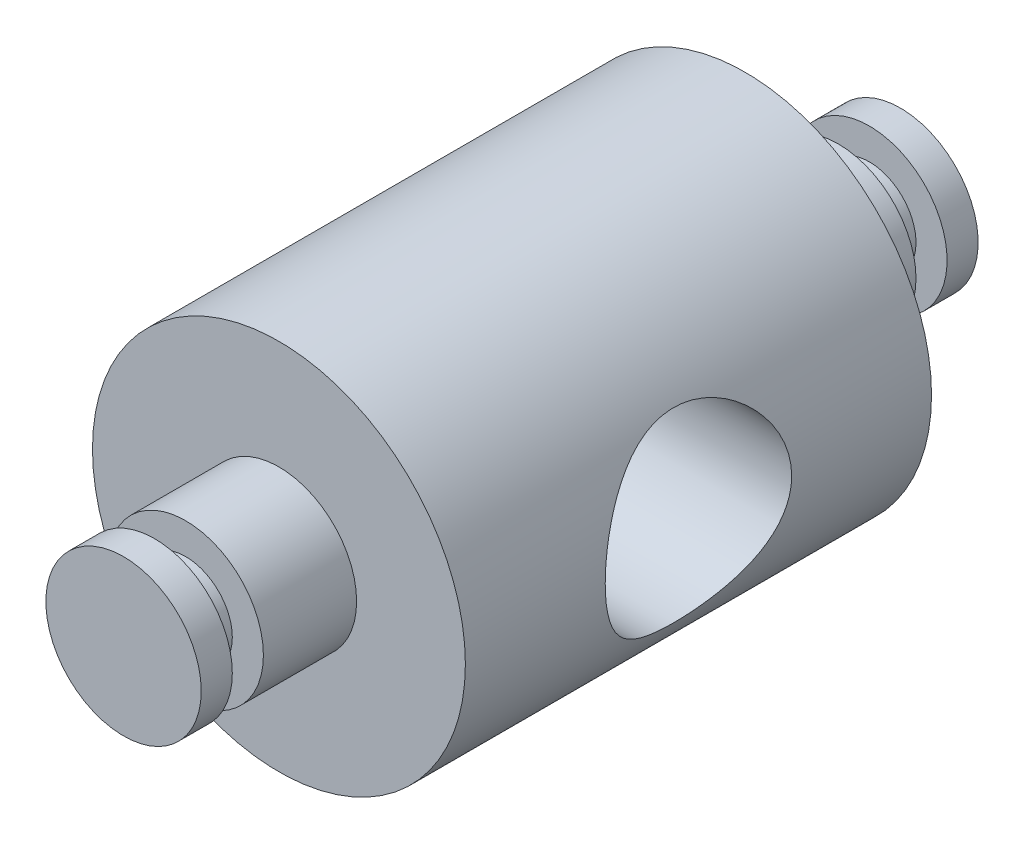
ISO-10303-21;
HEADER;
FILE_DESCRIPTION(('STEP AP214'),'2;1');
FILE_NAME('part.step','',(''),(''),'','','');
FILE_SCHEMA(('AUTOMOTIVE_DESIGN { 1 0 10303 214 1 1 1 1 }'));
ENDSEC;
DATA;
#1=APPLICATION_CONTEXT('core data for automotive mechanical design processes');
#2=APPLICATION_PROTOCOL_DEFINITION('international standard','automotive_design',2000,#1);
#3=PRODUCT_CONTEXT('',#1,'mechanical');
#4=PRODUCT('Part','Part','',(#3));
#5=PRODUCT_RELATED_PRODUCT_CATEGORY('part','',(#4));
#6=PRODUCT_DEFINITION_FORMATION('','',#4);
#7=PRODUCT_DEFINITION_CONTEXT('part definition',#1,'design');
#8=PRODUCT_DEFINITION('design','',#6,#7);
#9=PRODUCT_DEFINITION_SHAPE('','',#8);
#10=(LENGTH_UNIT() NAMED_UNIT(*) SI_UNIT(.MILLI.,.METRE.));
#11=(NAMED_UNIT(*) PLANE_ANGLE_UNIT() SI_UNIT($,.RADIAN.));
#12=(NAMED_UNIT(*) SI_UNIT($,.STERADIAN.) SOLID_ANGLE_UNIT());
#13=UNCERTAINTY_MEASURE_WITH_UNIT(LENGTH_MEASURE(1.E-05),#10,'distance_accuracy_value','');
#14=(GEOMETRIC_REPRESENTATION_CONTEXT(3) GLOBAL_UNCERTAINTY_ASSIGNED_CONTEXT((#13)) GLOBAL_UNIT_ASSIGNED_CONTEXT((#10,
#11,#12)) REPRESENTATION_CONTEXT('',''));
#15=CARTESIAN_POINT('',(0.,0.,0.));
#16=DIRECTION('',(0.,0.,1.));
#17=DIRECTION('',(1.,0.,0.));
#18=AXIS2_PLACEMENT_3D('',#15,#16,#17);
#19=CARTESIAN_POINT('',(0.,0.,-18.));
#20=DIRECTION('',(0.,0.,-1.));
#21=DIRECTION('',(-1.,0.,0.));
#22=AXIS2_PLACEMENT_3D('',#19,#20,#21);
#23=PLANE('',#22);
#24=CARTESIAN_POINT('',(0.,0.,-18.));
#25=DIRECTION('',(0.,0.,-1.));
#26=DIRECTION('',(-1.,0.,0.));
#27=AXIS2_PLACEMENT_3D('',#24,#25,#26);
#28=CIRCLE('',#27,2.5);
#29=CARTESIAN_POINT('',(-2.5,0.,-18.));
#30=VERTEX_POINT('',#29);
#31=EDGE_CURVE('E138',#30,#30,#28,.T.);
#32=ORIENTED_EDGE('',*,*,#31,.T.);
#33=EDGE_LOOP('',(#32));
#34=FACE_BOUND('',#33,.T.);
#35=CARTESIAN_POINT('',(0.,0.,-18.));
#36=DIRECTION('',(0.,0.,-1.));
#37=DIRECTION('',(-1.,0.,0.));
#38=AXIS2_PLACEMENT_3D('',#35,#36,#37);
#39=CIRCLE('',#38,1.5);
#40=CARTESIAN_POINT('',(-1.5,0.,-18.));
#41=VERTEX_POINT('',#40);
#42=EDGE_CURVE('E144',#41,#41,#39,.T.);
#43=ORIENTED_EDGE('',*,*,#42,.F.);
#44=EDGE_LOOP('',(#43));
#45=FACE_BOUND('',#44,.T.);
#46=ADVANCED_FACE('F26',(#34,#45),#23,.T.);
#47=CARTESIAN_POINT('',(0.,0.,-15.));
#48=DIRECTION('',(0.,0.,1.));
#49=DIRECTION('',(1.,0.,0.));
#50=AXIS2_PLACEMENT_3D('',#47,#48,#49);
#51=PLANE('',#50);
#52=CARTESIAN_POINT('',(0.,0.,-15.));
#53=DIRECTION('',(0.,0.,1.));
#54=DIRECTION('',(1.,0.,0.));
#55=AXIS2_PLACEMENT_3D('',#52,#53,#54);
#56=CIRCLE('',#55,6.);
#57=CARTESIAN_POINT('',(6.,0.,-15.));
#58=VERTEX_POINT('',#57);
#59=EDGE_CURVE('E38',#58,#58,#56,.T.);
#60=ORIENTED_EDGE('',*,*,#59,.F.);
#61=EDGE_LOOP('',(#60));
#62=FACE_BOUND('',#61,.T.);
#63=CARTESIAN_POINT('',(0.,0.,-15.));
#64=DIRECTION('',(0.,0.,1.));
#65=DIRECTION('',(1.,0.,0.));
#66=AXIS2_PLACEMENT_3D('',#63,#64,#65);
#67=CIRCLE('',#66,2.5);
#68=CARTESIAN_POINT('',(2.5,0.,-15.));
#69=VERTEX_POINT('',#68);
#70=EDGE_CURVE('E10',#69,#69,#67,.F.);
#71=ORIENTED_EDGE('',*,*,#70,.F.);
#72=EDGE_LOOP('',(#71));
#73=FACE_BOUND('',#72,.T.);
#74=ADVANCED_FACE('F75',(#62,#73),#51,.F.);
#75=CARTESIAN_POINT('',(0.,0.,3.));
#76=DIRECTION('',(0.,0.,1.));
#77=DIRECTION('',(1.,0.,0.));
#78=AXIS2_PLACEMENT_3D('',#75,#76,#77);
#79=PLANE('',#78);
#80=CARTESIAN_POINT('',(0.,0.,3.));
#81=DIRECTION('',(0.,0.,1.));
#82=DIRECTION('',(1.,0.,0.));
#83=AXIS2_PLACEMENT_3D('',#80,#81,#82);
#84=CIRCLE('',#83,2.5);
#85=CARTESIAN_POINT('',(2.5,0.,3.));
#86=VERTEX_POINT('',#85);
#87=EDGE_CURVE('E119',#86,#86,#84,.T.);
#88=ORIENTED_EDGE('',*,*,#87,.T.);
#89=EDGE_LOOP('',(#88));
#90=FACE_BOUND('',#89,.T.);
#91=CARTESIAN_POINT('',(0.,0.,3.));
#92=DIRECTION('',(0.,0.,1.));
#93=DIRECTION('',(1.,0.,0.));
#94=AXIS2_PLACEMENT_3D('',#91,#92,#93);
#95=CIRCLE('',#94,1.5);
#96=CARTESIAN_POINT('',(1.5,0.,3.));
#97=VERTEX_POINT('',#96);
#98=EDGE_CURVE('E129',#97,#97,#95,.T.);
#99=ORIENTED_EDGE('',*,*,#98,.F.);
#100=EDGE_LOOP('',(#99));
#101=FACE_BOUND('',#100,.T.);
#102=ADVANCED_FACE('F97',(#90,#101),#79,.T.);
#103=CARTESIAN_POINT('',(0.,0.,0.));
#104=DIRECTION('',(0.,0.,1.));
#105=DIRECTION('',(1.,0.,0.));
#106=AXIS2_PLACEMENT_3D('',#103,#104,#105);
#107=PLANE('',#106);
#108=CARTESIAN_POINT('',(0.,0.,0.));
#109=DIRECTION('',(0.,0.,1.));
#110=DIRECTION('',(1.,0.,0.));
#111=AXIS2_PLACEMENT_3D('',#108,#109,#110);
#112=CIRCLE('',#111,6.);
#113=CARTESIAN_POINT('',(6.,0.,0.));
#114=VERTEX_POINT('',#113);
#115=EDGE_CURVE('E43',#114,#114,#112,.T.);
#116=ORIENTED_EDGE('',*,*,#115,.T.);
#117=EDGE_LOOP('',(#116));
#118=FACE_BOUND('',#117,.T.);
#119=CARTESIAN_POINT('',(0.,0.,0.));
#120=DIRECTION('',(0.,0.,1.));
#121=DIRECTION('',(1.,0.,0.));
#122=AXIS2_PLACEMENT_3D('',#119,#120,#121);
#123=CIRCLE('',#122,2.5);
#124=CARTESIAN_POINT('',(2.5,0.,0.));
#125=VERTEX_POINT('',#124);
#126=EDGE_CURVE('E121',#125,#125,#123,.T.);
#127=ORIENTED_EDGE('',*,*,#126,.F.);
#128=EDGE_LOOP('',(#127));
#129=FACE_BOUND('',#128,.T.);
#130=ADVANCED_FACE('F100',(#118,#129),#107,.T.);
#131=CARTESIAN_POINT('',(0.,0.,-15.));
#132=DIRECTION('',(0.,0.,1.));
#133=DIRECTION('',(1.,0.,0.));
#134=AXIS2_PLACEMENT_3D('',#131,#132,#133);
#135=CYLINDRICAL_SURFACE('',#134,6.);
#136=CARTESIAN_POINT('',(6.,0.,-10.5));
#137=CARTESIAN_POINT('',(5.99999934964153,0.0788941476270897,-10.4999991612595));
#138=CARTESIAN_POINT('',(5.99843869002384,0.15779662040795,-10.4968820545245));
#139=CARTESIAN_POINT('',(5.99224358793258,0.315001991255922,-10.48446072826));
#140=CARTESIAN_POINT('',(5.98760776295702,0.393304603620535,-10.4751537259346));
#141=CARTESIAN_POINT('',(5.96921978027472,0.626628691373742,-10.4380421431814));
#142=CARTESIAN_POINT('',(5.95098734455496,0.77995289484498,-10.4010471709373));
#143=CARTESIAN_POINT('',(5.90448966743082,1.07683586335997,-10.3044182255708));
#144=CARTESIAN_POINT('',(5.87626344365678,1.22043005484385,-10.2448722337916));
#145=CARTESIAN_POINT('',(5.81237302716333,1.49540820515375,-10.1052887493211));
#146=CARTESIAN_POINT('',(5.77670942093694,1.62679312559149,-10.0252528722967));
#147=CARTESIAN_POINT('',(5.69868752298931,1.88252701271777,-9.84144601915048));
#148=CARTESIAN_POINT('',(5.65605474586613,2.0059694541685,-9.73653205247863));
#149=CARTESIAN_POINT('',(5.5698003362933,2.23433451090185,-9.50844407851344));
#150=CARTESIAN_POINT('',(5.5261779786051,2.3392430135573,-9.38525628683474));
#151=CARTESIAN_POINT('',(5.43896347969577,2.53576864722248,-9.11251563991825));
#152=CARTESIAN_POINT('',(5.39563602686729,2.62572411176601,-8.96165902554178));
#153=CARTESIAN_POINT('',(5.33782449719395,2.7403403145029,-8.72404914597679));
#154=CARTESIAN_POINT('',(5.31974570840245,2.77516786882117,-8.64292907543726));
#155=CARTESIAN_POINT('',(5.28665768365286,2.83769299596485,-8.47739942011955));
#156=CARTESIAN_POINT('',(5.27164663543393,2.86539478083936,-8.39299181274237));
#157=CARTESIAN_POINT('',(5.24610341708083,2.91188280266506,-8.22660420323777));
#158=CARTESIAN_POINT('',(5.23535838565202,2.93110042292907,-8.14477720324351));
#159=CARTESIAN_POINT('',(5.21757784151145,2.9626355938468,-7.9794450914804));
#160=CARTESIAN_POINT('',(5.21054036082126,2.97495680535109,-7.89594089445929));
#161=CARTESIAN_POINT('',(5.20047756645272,2.99251382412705,-7.72799363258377));
#162=CARTESIAN_POINT('',(5.19744983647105,2.99775389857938,-7.64355116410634));
#163=CARTESIAN_POINT('',(5.19552555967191,3.00108452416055,-7.47450634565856));
#164=CARTESIAN_POINT('',(5.19662861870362,2.9991757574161,-7.38990401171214));
#165=CARTESIAN_POINT('',(5.20534668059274,2.98404973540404,-7.15724610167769));
#166=CARTESIAN_POINT('',(5.21726794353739,2.96335042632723,-7.00975584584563));
#167=CARTESIAN_POINT('',(5.25228182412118,2.90082280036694,-6.72080632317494));
#168=CARTESIAN_POINT('',(5.2753780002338,2.85898775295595,-6.57934899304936));
#169=CARTESIAN_POINT('',(5.33062568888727,2.75462843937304,-6.30232034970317));
#170=CARTESIAN_POINT('',(5.36297559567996,2.69164495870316,-6.16696288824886));
#171=CARTESIAN_POINT('',(5.43310175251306,2.54712530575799,-5.90809503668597));
#172=CARTESIAN_POINT('',(5.47088043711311,2.46558080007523,-5.78459000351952));
#173=CARTESIAN_POINT('',(5.55339485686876,2.27419808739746,-5.53643690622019));
#174=CARTESIAN_POINT('',(5.59840533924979,2.16208335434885,-5.4136295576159));
#175=CARTESIAN_POINT('',(5.68642866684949,1.91866675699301,-5.18779356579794));
#176=CARTESIAN_POINT('',(5.72944054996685,1.78735577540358,-5.08477437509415));
#177=CARTESIAN_POINT('',(5.81105962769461,1.50154951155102,-4.89694306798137));
#178=CARTESIAN_POINT('',(5.84936952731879,1.3462607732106,-4.81319859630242));
#179=CARTESIAN_POINT('',(5.91473643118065,1.02139864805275,-4.67370889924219));
#180=CARTESIAN_POINT('',(5.94180236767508,0.851836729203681,-4.61794144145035));
#181=CARTESIAN_POINT('',(5.97973001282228,0.518299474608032,-4.54057379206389));
#182=CARTESIAN_POINT('',(5.99174814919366,0.355024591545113,-4.51652629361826));
#183=CARTESIAN_POINT('',(6.00219040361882,0.0263387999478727,-4.49560580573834));
#184=CARTESIAN_POINT('',(6.00062096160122,-0.13907105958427,-4.49871994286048));
#185=CARTESIAN_POINT('',(5.98473576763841,-0.453698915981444,-4.53062006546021));
#186=CARTESIAN_POINT('',(5.97141737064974,-0.603178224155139,-4.55739759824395));
#187=CARTESIAN_POINT('',(5.93466513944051,-0.895220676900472,-4.6327142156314));
#188=CARTESIAN_POINT('',(5.91123019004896,-1.03778305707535,-4.68125569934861));
#189=CARTESIAN_POINT('',(5.85552754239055,-1.31666582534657,-4.79999539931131));
#190=CARTESIAN_POINT('',(5.82302645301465,-1.45269119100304,-4.87077315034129));
#191=CARTESIAN_POINT('',(5.75231922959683,-1.71138408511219,-5.03132260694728));
#192=CARTESIAN_POINT('',(5.71411066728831,-1.83404588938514,-5.12110240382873));
#193=CARTESIAN_POINT('',(5.63124663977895,-2.07530306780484,-5.32728127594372));
#194=CARTESIAN_POINT('',(5.58632654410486,-2.19231623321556,-5.44542860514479));
#195=CARTESIAN_POINT('',(5.49787174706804,-2.40556896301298,-5.6997754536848));
#196=CARTESIAN_POINT('',(5.4543380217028,-2.50179415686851,-5.83598735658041));
#197=CARTESIAN_POINT('',(5.37153576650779,-2.675123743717,-6.13093096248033));
#198=CARTESIAN_POINT('',(5.33257588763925,-2.75107648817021,-6.29043379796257));
#199=CARTESIAN_POINT('',(5.26722216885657,-2.87424847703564,-6.62253020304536));
#200=CARTESIAN_POINT('',(5.24081214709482,-2.92150474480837,-6.7951065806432));
#201=CARTESIAN_POINT('',(5.2068450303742,-2.98158506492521,-7.13073066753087));
#202=CARTESIAN_POINT('',(5.19772150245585,-2.997278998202,-7.29310275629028));
#203=CARTESIAN_POINT('',(5.19496064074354,-3.00206745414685,-7.61834120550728));
#204=CARTESIAN_POINT('',(5.20131659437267,-2.99117350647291,-7.78120732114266));
#205=CARTESIAN_POINT('',(5.22713585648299,-2.94577840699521,-8.08645049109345));
#206=CARTESIAN_POINT('',(5.24529281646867,-2.91362505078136,-8.22930136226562));
#207=CARTESIAN_POINT('',(5.29113050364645,-2.82952596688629,-8.5074244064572));
#208=CARTESIAN_POINT('',(5.3188142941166,-2.77757387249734,-8.64269412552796));
#209=CARTESIAN_POINT('',(5.38285583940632,-2.65144766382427,-8.91187436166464));
#210=CARTESIAN_POINT('',(5.41967139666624,-2.57601505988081,-9.04508296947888));
#211=CARTESIAN_POINT('',(5.49706022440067,-2.40645126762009,-9.29782434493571));
#212=CARTESIAN_POINT('',(5.53763544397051,-2.31231035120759,-9.41734994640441));
#213=CARTESIAN_POINT('',(5.62386853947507,-2.09461689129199,-9.65442285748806));
#214=CARTESIAN_POINT('',(5.66954494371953,-1.96888052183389,-9.7699651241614));
#215=CARTESIAN_POINT('',(5.75633712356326,-1.69843715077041,-9.97880114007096));
#216=CARTESIAN_POINT('',(5.79745043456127,-1.55371998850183,-10.0720828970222));
#217=CARTESIAN_POINT('',(5.85251406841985,-1.32452333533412,-10.1931781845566));
#218=CARTESIAN_POINT('',(5.86982524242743,-1.24575314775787,-10.2305202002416));
#219=CARTESIAN_POINT('',(5.90168845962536,-1.08479725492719,-10.2983616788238));
#220=CARTESIAN_POINT('',(5.91624185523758,-1.00261324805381,-10.3288644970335));
#221=CARTESIAN_POINT('',(5.94212690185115,-0.835616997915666,-10.3826072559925));
#222=CARTESIAN_POINT('',(5.95346557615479,-0.750810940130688,-10.405863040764));
#223=CARTESIAN_POINT('',(5.97260771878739,-0.579142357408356,-10.4448825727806));
#224=CARTESIAN_POINT('',(5.98041334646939,-0.492281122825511,-10.4606508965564));
#225=CARTESIAN_POINT('',(5.99085829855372,-0.337824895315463,-10.4816846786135));
#226=CARTESIAN_POINT('',(5.99428035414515,-0.270495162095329,-10.488546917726));
#227=CARTESIAN_POINT('',(5.99885151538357,-0.135445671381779,-10.497705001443));
#228=CARTESIAN_POINT('',(6.00000055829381,-0.0677259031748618,-10.5000007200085));
#229=CARTESIAN_POINT('',(6.,0.,-10.5));
#230=B_SPLINE_CURVE_WITH_KNOTS('',3,(#136,#137,#138,#139,#140,#141,#142,#143,#144,#145,#146,
#147,#148,#149,#150,#151,#152,#153,#154,#155,#156,#157,#158,#159,#160,#161,#162,#163,#164,#165,
#166,#167,#168,#169,#170,#171,#172,#173,#174,#175,#176,#177,#178,#179,#180,#181,#182,#183,#184,
#185,#186,#187,#188,#189,#190,#191,#192,#193,#194,#195,#196,#197,#198,#199,#200,#201,#202,#203,
#204,#205,#206,#207,#208,#209,#210,#211,#212,#213,#214,#215,#216,#217,#218,#219,#220,#221,#222,
#223,#224,#225,#226,#227,#228,#229),.UNSPECIFIED.,.T.,.F.,(4,2,2,2,2,2,2,2,2,2,2,2,2,2,2,2,2,2,
2,2,2,2,2,2,2,2,2,2,2,2,2,2,2,2,2,2,2,2,2,2,2,2,2,2,2,2,4),(0.,0.236611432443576,
0.4733293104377,0.947100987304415,1.41904300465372,1.89094781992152,2.39140181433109,
2.89223525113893,3.4319083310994,3.70192714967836,3.97178599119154,4.22563720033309,
4.47935352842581,4.73291689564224,4.98645606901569,5.43238672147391,5.87845946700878,
6.33492255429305,6.79159098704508,7.30616358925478,7.82098138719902,8.35970601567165,
8.89800185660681,9.39171406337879,9.88519228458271,10.3404225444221,10.7957029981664,
11.2640010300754,11.7324988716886,12.2470036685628,12.7618630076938,13.3016558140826,
13.8407507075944,14.3280945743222,14.8152271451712,15.2559532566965,15.6968212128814,
16.1673090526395,16.6380421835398,17.1659726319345,17.6941868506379,17.9605054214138,
18.2266930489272,18.4922945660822,18.7577335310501,18.9608446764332,19.1639614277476),.UNSPECIFIED.);
#231=CARTESIAN_POINT('',(6.,0.,-10.5));
#232=VERTEX_POINT('',#231);
#233=EDGE_CURVE('E31',#232,#232,#230,.T.);
#234=ORIENTED_EDGE('',*,*,#233,.F.);
#235=EDGE_LOOP('',(#234));
#236=FACE_BOUND('',#235,.T.);
#237=CARTESIAN_POINT('',(-6.,0.,-10.5));
#238=CARTESIAN_POINT('',(-5.99999934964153,-0.0788941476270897,-10.4999991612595));
#239=CARTESIAN_POINT('',(-5.99843869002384,-0.15779662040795,-10.4968820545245));
#240=CARTESIAN_POINT('',(-5.99224358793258,-0.315001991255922,-10.48446072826));
#241=CARTESIAN_POINT('',(-5.98760776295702,-0.393304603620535,-10.4751537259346));
#242=CARTESIAN_POINT('',(-5.96921978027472,-0.626628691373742,-10.4380421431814));
#243=CARTESIAN_POINT('',(-5.95098734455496,-0.77995289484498,-10.4010471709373));
#244=CARTESIAN_POINT('',(-5.90448966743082,-1.07683586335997,-10.3044182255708));
#245=CARTESIAN_POINT('',(-5.87626344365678,-1.22043005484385,-10.2448722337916));
#246=CARTESIAN_POINT('',(-5.81237302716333,-1.49540820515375,-10.1052887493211));
#247=CARTESIAN_POINT('',(-5.77670942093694,-1.62679312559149,-10.0252528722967));
#248=CARTESIAN_POINT('',(-5.69868752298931,-1.88252701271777,-9.84144601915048));
#249=CARTESIAN_POINT('',(-5.65605474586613,-2.0059694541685,-9.73653205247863));
#250=CARTESIAN_POINT('',(-5.5698003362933,-2.23433451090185,-9.50844407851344));
#251=CARTESIAN_POINT('',(-5.5261779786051,-2.3392430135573,-9.38525628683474));
#252=CARTESIAN_POINT('',(-5.43896347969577,-2.53576864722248,-9.11251563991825));
#253=CARTESIAN_POINT('',(-5.39563602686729,-2.62572411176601,-8.96165902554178));
#254=CARTESIAN_POINT('',(-5.33782449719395,-2.7403403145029,-8.72404914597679));
#255=CARTESIAN_POINT('',(-5.31974570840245,-2.77516786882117,-8.64292907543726));
#256=CARTESIAN_POINT('',(-5.28665768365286,-2.83769299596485,-8.47739942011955));
#257=CARTESIAN_POINT('',(-5.27164663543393,-2.86539478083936,-8.39299181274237));
#258=CARTESIAN_POINT('',(-5.24610341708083,-2.91188280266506,-8.22660420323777));
#259=CARTESIAN_POINT('',(-5.23535838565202,-2.93110042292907,-8.14477720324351));
#260=CARTESIAN_POINT('',(-5.21757784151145,-2.9626355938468,-7.9794450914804));
#261=CARTESIAN_POINT('',(-5.21054036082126,-2.97495680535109,-7.89594089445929));
#262=CARTESIAN_POINT('',(-5.20047756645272,-2.99251382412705,-7.72799363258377));
#263=CARTESIAN_POINT('',(-5.19744983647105,-2.99775389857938,-7.64355116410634));
#264=CARTESIAN_POINT('',(-5.19552555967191,-3.00108452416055,-7.47450634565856));
#265=CARTESIAN_POINT('',(-5.19662861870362,-2.9991757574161,-7.38990401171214));
#266=CARTESIAN_POINT('',(-5.20534668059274,-2.98404973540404,-7.15724610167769));
#267=CARTESIAN_POINT('',(-5.21726794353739,-2.96335042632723,-7.00975584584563));
#268=CARTESIAN_POINT('',(-5.25228182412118,-2.90082280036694,-6.72080632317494));
#269=CARTESIAN_POINT('',(-5.2753780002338,-2.85898775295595,-6.57934899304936));
#270=CARTESIAN_POINT('',(-5.33062568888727,-2.75462843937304,-6.30232034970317));
#271=CARTESIAN_POINT('',(-5.36297559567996,-2.69164495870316,-6.16696288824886));
#272=CARTESIAN_POINT('',(-5.43310175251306,-2.54712530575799,-5.90809503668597));
#273=CARTESIAN_POINT('',(-5.47088043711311,-2.46558080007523,-5.78459000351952));
#274=CARTESIAN_POINT('',(-5.55339485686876,-2.27419808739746,-5.53643690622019));
#275=CARTESIAN_POINT('',(-5.59840533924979,-2.16208335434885,-5.4136295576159));
#276=CARTESIAN_POINT('',(-5.68642866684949,-1.91866675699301,-5.18779356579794));
#277=CARTESIAN_POINT('',(-5.72944054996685,-1.78735577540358,-5.08477437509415));
#278=CARTESIAN_POINT('',(-5.81105962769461,-1.50154951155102,-4.89694306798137));
#279=CARTESIAN_POINT('',(-5.84936952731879,-1.3462607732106,-4.81319859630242));
#280=CARTESIAN_POINT('',(-5.91473643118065,-1.02139864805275,-4.67370889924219));
#281=CARTESIAN_POINT('',(-5.94180236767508,-0.851836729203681,-4.61794144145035));
#282=CARTESIAN_POINT('',(-5.97973001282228,-0.518299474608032,-4.54057379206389));
#283=CARTESIAN_POINT('',(-5.99174814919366,-0.355024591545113,-4.51652629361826));
#284=CARTESIAN_POINT('',(-6.00219040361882,-0.0263387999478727,-4.49560580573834));
#285=CARTESIAN_POINT('',(-6.00062096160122,0.13907105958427,-4.49871994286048));
#286=CARTESIAN_POINT('',(-5.98473576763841,0.453698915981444,-4.53062006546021));
#287=CARTESIAN_POINT('',(-5.97141737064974,0.603178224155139,-4.55739759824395));
#288=CARTESIAN_POINT('',(-5.93466513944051,0.895220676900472,-4.6327142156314));
#289=CARTESIAN_POINT('',(-5.91123019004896,1.03778305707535,-4.68125569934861));
#290=CARTESIAN_POINT('',(-5.85552754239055,1.31666582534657,-4.79999539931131));
#291=CARTESIAN_POINT('',(-5.82302645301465,1.45269119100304,-4.87077315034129));
#292=CARTESIAN_POINT('',(-5.75231922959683,1.71138408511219,-5.03132260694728));
#293=CARTESIAN_POINT('',(-5.71411066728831,1.83404588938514,-5.12110240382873));
#294=CARTESIAN_POINT('',(-5.63124663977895,2.07530306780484,-5.32728127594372));
#295=CARTESIAN_POINT('',(-5.58632654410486,2.19231623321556,-5.44542860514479));
#296=CARTESIAN_POINT('',(-5.49787174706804,2.40556896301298,-5.6997754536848));
#297=CARTESIAN_POINT('',(-5.4543380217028,2.50179415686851,-5.83598735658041));
#298=CARTESIAN_POINT('',(-5.37153576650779,2.675123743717,-6.13093096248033));
#299=CARTESIAN_POINT('',(-5.33257588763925,2.75107648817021,-6.29043379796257));
#300=CARTESIAN_POINT('',(-5.26722216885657,2.87424847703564,-6.62253020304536));
#301=CARTESIAN_POINT('',(-5.24081214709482,2.92150474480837,-6.7951065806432));
#302=CARTESIAN_POINT('',(-5.2068450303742,2.98158506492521,-7.13073066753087));
#303=CARTESIAN_POINT('',(-5.19772150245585,2.997278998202,-7.29310275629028));
#304=CARTESIAN_POINT('',(-5.19496064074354,3.00206745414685,-7.61834120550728));
#305=CARTESIAN_POINT('',(-5.20131659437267,2.99117350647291,-7.78120732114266));
#306=CARTESIAN_POINT('',(-5.22713585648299,2.94577840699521,-8.08645049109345));
#307=CARTESIAN_POINT('',(-5.24529281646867,2.91362505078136,-8.22930136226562));
#308=CARTESIAN_POINT('',(-5.29113050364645,2.82952596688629,-8.5074244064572));
#309=CARTESIAN_POINT('',(-5.3188142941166,2.77757387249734,-8.64269412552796));
#310=CARTESIAN_POINT('',(-5.38285583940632,2.65144766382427,-8.91187436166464));
#311=CARTESIAN_POINT('',(-5.41967139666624,2.57601505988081,-9.04508296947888));
#312=CARTESIAN_POINT('',(-5.49706022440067,2.40645126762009,-9.29782434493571));
#313=CARTESIAN_POINT('',(-5.53763544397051,2.31231035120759,-9.41734994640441));
#314=CARTESIAN_POINT('',(-5.62386853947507,2.09461689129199,-9.65442285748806));
#315=CARTESIAN_POINT('',(-5.66954494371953,1.96888052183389,-9.7699651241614));
#316=CARTESIAN_POINT('',(-5.75633712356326,1.69843715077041,-9.97880114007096));
#317=CARTESIAN_POINT('',(-5.79745043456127,1.55371998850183,-10.0720828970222));
#318=CARTESIAN_POINT('',(-5.85251406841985,1.32452333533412,-10.1931781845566));
#319=CARTESIAN_POINT('',(-5.86982524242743,1.24575314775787,-10.2305202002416));
#320=CARTESIAN_POINT('',(-5.90168845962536,1.08479725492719,-10.2983616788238));
#321=CARTESIAN_POINT('',(-5.91624185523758,1.00261324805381,-10.3288644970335));
#322=CARTESIAN_POINT('',(-5.94212690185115,0.835616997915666,-10.3826072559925));
#323=CARTESIAN_POINT('',(-5.95346557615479,0.750810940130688,-10.405863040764));
#324=CARTESIAN_POINT('',(-5.97260771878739,0.579142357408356,-10.4448825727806));
#325=CARTESIAN_POINT('',(-5.98041334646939,0.492281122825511,-10.4606508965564));
#326=CARTESIAN_POINT('',(-5.99085829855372,0.337824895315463,-10.4816846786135));
#327=CARTESIAN_POINT('',(-5.99428035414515,0.270495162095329,-10.488546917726));
#328=CARTESIAN_POINT('',(-5.99885151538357,0.135445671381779,-10.497705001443));
#329=CARTESIAN_POINT('',(-6.00000055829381,0.0677259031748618,-10.5000007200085));
#330=CARTESIAN_POINT('',(-6.,0.,-10.5));
#331=B_SPLINE_CURVE_WITH_KNOTS('',3,(#237,#238,#239,#240,#241,#242,#243,#244,#245,#246,#247,
#248,#249,#250,#251,#252,#253,#254,#255,#256,#257,#258,#259,#260,#261,#262,#263,#264,#265,#266,
#267,#268,#269,#270,#271,#272,#273,#274,#275,#276,#277,#278,#279,#280,#281,#282,#283,#284,#285,
#286,#287,#288,#289,#290,#291,#292,#293,#294,#295,#296,#297,#298,#299,#300,#301,#302,#303,#304,
#305,#306,#307,#308,#309,#310,#311,#312,#313,#314,#315,#316,#317,#318,#319,#320,#321,#322,#323,
#324,#325,#326,#327,#328,#329,#330),.UNSPECIFIED.,.T.,.F.,(4,2,2,2,2,2,2,2,2,2,2,2,2,2,2,2,2,2,
2,2,2,2,2,2,2,2,2,2,2,2,2,2,2,2,2,2,2,2,2,2,2,2,2,2,2,2,4),(0.,0.236611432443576,
0.4733293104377,0.947100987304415,1.41904300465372,1.89094781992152,2.39140181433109,
2.89223525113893,3.4319083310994,3.70192714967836,3.97178599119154,4.22563720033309,
4.47935352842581,4.73291689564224,4.98645606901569,5.43238672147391,5.87845946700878,
6.33492255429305,6.79159098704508,7.30616358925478,7.82098138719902,8.35970601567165,
8.89800185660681,9.39171406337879,9.88519228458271,10.3404225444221,10.7957029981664,
11.2640010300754,11.7324988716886,12.2470036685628,12.7618630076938,13.3016558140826,
13.8407507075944,14.3280945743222,14.8152271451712,15.2559532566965,15.6968212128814,
16.1673090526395,16.6380421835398,17.1659726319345,17.6941868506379,17.9605054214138,
18.2266930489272,18.4922945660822,18.7577335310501,18.9608446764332,19.1639614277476),.UNSPECIFIED.);
#332=CARTESIAN_POINT('',(-6.,0.,-10.5));
#333=VERTEX_POINT('',#332);
#334=EDGE_CURVE('E46',#333,#333,#331,.T.);
#335=ORIENTED_EDGE('',*,*,#334,.F.);
#336=EDGE_LOOP('',(#335));
#337=FACE_BOUND('',#336,.T.);
#338=ORIENTED_EDGE('',*,*,#59,.T.);
#339=EDGE_LOOP('',(#338));
#340=FACE_BOUND('',#339,.T.);
#341=ORIENTED_EDGE('',*,*,#115,.F.);
#342=EDGE_LOOP('',(#341));
#343=FACE_BOUND('',#342,.T.);
#344=ADVANCED_FACE('F28',(#236,#337,#340,#343),#135,.T.);
#345=CARTESIAN_POINT('',(0.,0.,3.));
#346=DIRECTION('',(0.,0.,-1.));
#347=DIRECTION('',(-1.,0.,0.));
#348=AXIS2_PLACEMENT_3D('',#345,#346,#347);
#349=CYLINDRICAL_SURFACE('',#348,2.5);
#350=ORIENTED_EDGE('',*,*,#87,.F.);
#351=EDGE_LOOP('',(#350));
#352=FACE_BOUND('',#351,.T.);
#353=ORIENTED_EDGE('',*,*,#126,.T.);
#354=EDGE_LOOP('',(#353));
#355=FACE_BOUND('',#354,.T.);
#356=ADVANCED_FACE('F95',(#352,#355),#349,.T.);
#357=CARTESIAN_POINT('',(0.,0.,4.));
#358=DIRECTION('',(0.,0.,-1.));
#359=DIRECTION('',(-1.,0.,0.));
#360=AXIS2_PLACEMENT_3D('',#357,#358,#359);
#361=CYLINDRICAL_SURFACE('',#360,1.5);
#362=CARTESIAN_POINT('',(0.,0.,4.));
#363=DIRECTION('',(0.,0.,1.));
#364=DIRECTION('',(1.,0.,0.));
#365=AXIS2_PLACEMENT_3D('',#362,#363,#364);
#366=CIRCLE('',#365,1.5);
#367=CARTESIAN_POINT('',(1.5,0.,4.));
#368=VERTEX_POINT('',#367);
#369=EDGE_CURVE('E126',#368,#368,#366,.T.);
#370=ORIENTED_EDGE('',*,*,#369,.F.);
#371=EDGE_LOOP('',(#370));
#372=FACE_BOUND('',#371,.T.);
#373=ORIENTED_EDGE('',*,*,#98,.T.);
#374=EDGE_LOOP('',(#373));
#375=FACE_BOUND('',#374,.T.);
#376=ADVANCED_FACE('F85',(#372,#375),#361,.T.);
#377=CARTESIAN_POINT('',(0.,0.,4.));
#378=DIRECTION('',(0.,0.,1.));
#379=DIRECTION('',(1.,0.,0.));
#380=AXIS2_PLACEMENT_3D('',#377,#378,#379);
#381=PLANE('',#380);
#382=CARTESIAN_POINT('',(0.,0.,4.));
#383=DIRECTION('',(0.,0.,1.));
#384=DIRECTION('',(1.,0.,0.));
#385=AXIS2_PLACEMENT_3D('',#382,#383,#384);
#386=CIRCLE('',#385,2.5);
#387=CARTESIAN_POINT('',(2.5,0.,4.));
#388=VERTEX_POINT('',#387);
#389=EDGE_CURVE('E135',#388,#388,#386,.T.);
#390=ORIENTED_EDGE('',*,*,#389,.F.);
#391=EDGE_LOOP('',(#390));
#392=FACE_BOUND('',#391,.T.);
#393=ORIENTED_EDGE('',*,*,#369,.T.);
#394=EDGE_LOOP('',(#393));
#395=FACE_BOUND('',#394,.T.);
#396=ADVANCED_FACE('F81',(#392,#395),#381,.F.);
#397=CARTESIAN_POINT('',(0.,0.,5.));
#398=DIRECTION('',(0.,0.,-1.));
#399=DIRECTION('',(-1.,0.,0.));
#400=AXIS2_PLACEMENT_3D('',#397,#398,#399);
#401=CYLINDRICAL_SURFACE('',#400,2.5);
#402=CARTESIAN_POINT('',(0.,0.,5.));
#403=DIRECTION('',(0.,0.,1.));
#404=DIRECTION('',(1.,0.,0.));
#405=AXIS2_PLACEMENT_3D('',#402,#403,#404);
#406=CIRCLE('',#405,2.5);
#407=CARTESIAN_POINT('',(2.5,0.,5.));
#408=VERTEX_POINT('',#407);
#409=EDGE_CURVE('E132',#408,#408,#406,.T.);
#410=ORIENTED_EDGE('',*,*,#409,.F.);
#411=EDGE_LOOP('',(#410));
#412=FACE_BOUND('',#411,.T.);
#413=ORIENTED_EDGE('',*,*,#389,.T.);
#414=EDGE_LOOP('',(#413));
#415=FACE_BOUND('',#414,.T.);
#416=ADVANCED_FACE('F84',(#412,#415),#401,.T.);
#417=CARTESIAN_POINT('',(0.,0.,5.));
#418=DIRECTION('',(0.,0.,1.));
#419=DIRECTION('',(1.,0.,0.));
#420=AXIS2_PLACEMENT_3D('',#417,#418,#419);
#421=PLANE('',#420);
#422=ORIENTED_EDGE('',*,*,#409,.T.);
#423=EDGE_LOOP('',(#422));
#424=FACE_BOUND('',#423,.T.);
#425=ADVANCED_FACE('F79',(#424),#421,.T.);
#426=CARTESIAN_POINT('',(0.,0.,-18.));
#427=DIRECTION('',(0.,0.,1.));
#428=DIRECTION('',(1.,0.,0.));
#429=AXIS2_PLACEMENT_3D('',#426,#427,#428);
#430=CYLINDRICAL_SURFACE('',#429,2.5);
#431=ORIENTED_EDGE('',*,*,#31,.F.);
#432=EDGE_LOOP('',(#431));
#433=FACE_BOUND('',#432,.T.);
#434=ORIENTED_EDGE('',*,*,#70,.T.);
#435=EDGE_LOOP('',(#434));
#436=FACE_BOUND('',#435,.T.);
#437=ADVANCED_FACE('F71',(#433,#436),#430,.T.);
#438=CARTESIAN_POINT('',(0.,0.,-19.));
#439=DIRECTION('',(0.,0.,1.));
#440=DIRECTION('',(1.,0.,0.));
#441=AXIS2_PLACEMENT_3D('',#438,#439,#440);
#442=CYLINDRICAL_SURFACE('',#441,1.5);
#443=CARTESIAN_POINT('',(0.,0.,-19.));
#444=DIRECTION('',(0.,0.,-1.));
#445=DIRECTION('',(-1.,0.,0.));
#446=AXIS2_PLACEMENT_3D('',#443,#444,#445);
#447=CIRCLE('',#446,1.5);
#448=CARTESIAN_POINT('',(-1.5,0.,-19.));
#449=VERTEX_POINT('',#448);
#450=EDGE_CURVE('E141',#449,#449,#447,.T.);
#451=ORIENTED_EDGE('',*,*,#450,.F.);
#452=EDGE_LOOP('',(#451));
#453=FACE_BOUND('',#452,.T.);
#454=ORIENTED_EDGE('',*,*,#42,.T.);
#455=EDGE_LOOP('',(#454));
#456=FACE_BOUND('',#455,.T.);
#457=ADVANCED_FACE('F61',(#453,#456),#442,.T.);
#458=CARTESIAN_POINT('',(0.,0.,-19.));
#459=DIRECTION('',(0.,0.,-1.));
#460=DIRECTION('',(-1.,0.,0.));
#461=AXIS2_PLACEMENT_3D('',#458,#459,#460);
#462=PLANE('',#461);
#463=CARTESIAN_POINT('',(0.,0.,-19.));
#464=DIRECTION('',(0.,0.,-1.));
#465=DIRECTION('',(-1.,0.,0.));
#466=AXIS2_PLACEMENT_3D('',#463,#464,#465);
#467=CIRCLE('',#466,2.5);
#468=CARTESIAN_POINT('',(-2.5,0.,-19.));
#469=VERTEX_POINT('',#468);
#470=EDGE_CURVE('E150',#469,#469,#467,.T.);
#471=ORIENTED_EDGE('',*,*,#470,.F.);
#472=EDGE_LOOP('',(#471));
#473=FACE_BOUND('',#472,.T.);
#474=ORIENTED_EDGE('',*,*,#450,.T.);
#475=EDGE_LOOP('',(#474));
#476=FACE_BOUND('',#475,.T.);
#477=ADVANCED_FACE('F56',(#473,#476),#462,.F.);
#478=CARTESIAN_POINT('',(0.,0.,-20.));
#479=DIRECTION('',(0.,0.,1.));
#480=DIRECTION('',(1.,0.,0.));
#481=AXIS2_PLACEMENT_3D('',#478,#479,#480);
#482=CYLINDRICAL_SURFACE('',#481,2.5);
#483=CARTESIAN_POINT('',(0.,0.,-20.));
#484=DIRECTION('',(0.,0.,-1.));
#485=DIRECTION('',(-1.,0.,0.));
#486=AXIS2_PLACEMENT_3D('',#483,#484,#485);
#487=CIRCLE('',#486,2.5);
#488=CARTESIAN_POINT('',(-2.5,0.,-20.));
#489=VERTEX_POINT('',#488);
#490=EDGE_CURVE('E147',#489,#489,#487,.T.);
#491=ORIENTED_EDGE('',*,*,#490,.F.);
#492=EDGE_LOOP('',(#491));
#493=FACE_BOUND('',#492,.T.);
#494=ORIENTED_EDGE('',*,*,#470,.T.);
#495=EDGE_LOOP('',(#494));
#496=FACE_BOUND('',#495,.T.);
#497=ADVANCED_FACE('F60',(#493,#496),#482,.T.);
#498=CARTESIAN_POINT('',(0.,0.,-20.));
#499=DIRECTION('',(0.,0.,-1.));
#500=DIRECTION('',(-1.,0.,0.));
#501=AXIS2_PLACEMENT_3D('',#498,#499,#500);
#502=PLANE('',#501);
#503=ORIENTED_EDGE('',*,*,#490,.T.);
#504=EDGE_LOOP('',(#503));
#505=FACE_BOUND('',#504,.T.);
#506=ADVANCED_FACE('F54',(#505),#502,.T.);
#507=CARTESIAN_POINT('',(-13.,0.,-7.5));
#508=DIRECTION('',(1.,0.,0.));
#509=DIRECTION('',(0.,0.,-1.));
#510=AXIS2_PLACEMENT_3D('',#507,#508,#509);
#511=CYLINDRICAL_SURFACE('',#510,3.);
#512=ORIENTED_EDGE('',*,*,#233,.T.);
#513=EDGE_LOOP('',(#512));
#514=FACE_BOUND('',#513,.T.);
#515=ORIENTED_EDGE('',*,*,#334,.T.);
#516=EDGE_LOOP('',(#515));
#517=FACE_BOUND('',#516,.T.);
#518=ADVANCED_FACE('F50',(#514,#517),#511,.F.);
#519=CLOSED_SHELL('',(#46,#74,#102,#130,#344,#356,#376,#396,#416,#425,#437,#457,#477,#497,#506,#518));
#520=MANIFOLD_SOLID_BREP('B2',#519);
#521=ADVANCED_BREP_SHAPE_REPRESENTATION('',(#18,#520),#14);
#522=SHAPE_DEFINITION_REPRESENTATION(#9,#521);
ENDSEC;
END-ISO-10303-21;
